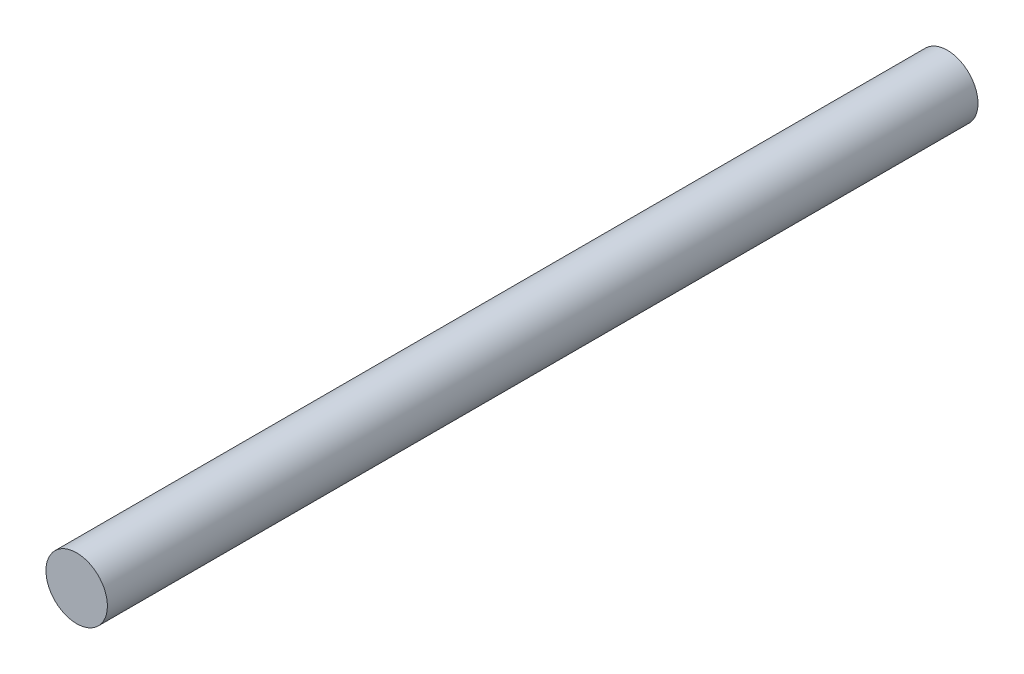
ISO-10303-21;
HEADER;
FILE_DESCRIPTION(('STEP AP214'),'2;1');
FILE_NAME('part.step','',(''),(''),'','','');
FILE_SCHEMA(('AUTOMOTIVE_DESIGN { 1 0 10303 214 1 1 1 1 }'));
ENDSEC;
DATA;
#1=APPLICATION_CONTEXT('core data for automotive mechanical design processes');
#2=APPLICATION_PROTOCOL_DEFINITION('international standard','automotive_design',2000,#1);
#3=PRODUCT_CONTEXT('',#1,'mechanical');
#4=PRODUCT('Part','Part','',(#3));
#5=PRODUCT_RELATED_PRODUCT_CATEGORY('part','',(#4));
#6=PRODUCT_DEFINITION_FORMATION('','',#4);
#7=PRODUCT_DEFINITION_CONTEXT('part definition',#1,'design');
#8=PRODUCT_DEFINITION('design','',#6,#7);
#9=PRODUCT_DEFINITION_SHAPE('','',#8);
#10=(LENGTH_UNIT() NAMED_UNIT(*) SI_UNIT(.MILLI.,.METRE.));
#11=(NAMED_UNIT(*) PLANE_ANGLE_UNIT() SI_UNIT($,.RADIAN.));
#12=(NAMED_UNIT(*) SI_UNIT($,.STERADIAN.) SOLID_ANGLE_UNIT());
#13=UNCERTAINTY_MEASURE_WITH_UNIT(LENGTH_MEASURE(1.E-05),#10,'distance_accuracy_value','');
#14=(GEOMETRIC_REPRESENTATION_CONTEXT(3) GLOBAL_UNCERTAINTY_ASSIGNED_CONTEXT((#13)) GLOBAL_UNIT_ASSIGNED_CONTEXT((#10,
#11,#12)) REPRESENTATION_CONTEXT('',''));
#15=CARTESIAN_POINT('',(0.,0.,0.));
#16=DIRECTION('',(0.,0.,1.));
#17=DIRECTION('',(1.,0.,0.));
#18=AXIS2_PLACEMENT_3D('',#15,#16,#17);
#19=CARTESIAN_POINT('',(0.,0.,-850.));
#20=DIRECTION('',(0.,0.,1.));
#21=DIRECTION('',(1.,0.,0.));
#22=AXIS2_PLACEMENT_3D('',#19,#20,#21);
#23=CYLINDRICAL_SURFACE('',#22,30.);
#24=CARTESIAN_POINT('',(0.,0.,-850.));
#25=DIRECTION('',(0.,0.,1.));
#26=DIRECTION('',(1.,0.,0.));
#27=AXIS2_PLACEMENT_3D('',#24,#25,#26);
#28=CIRCLE('',#27,30.);
#29=CARTESIAN_POINT('',(30.,0.,-850.));
#30=VERTEX_POINT('',#29);
#31=EDGE_CURVE('E10',#30,#30,#28,.T.);
#32=ORIENTED_EDGE('',*,*,#31,.T.);
#33=EDGE_LOOP('',(#32));
#34=FACE_BOUND('',#33,.T.);
#35=CARTESIAN_POINT('',(0.,0.,0.));
#36=DIRECTION('',(0.,0.,1.));
#37=DIRECTION('',(1.,0.,0.));
#38=AXIS2_PLACEMENT_3D('',#35,#36,#37);
#39=CIRCLE('',#38,30.);
#40=CARTESIAN_POINT('',(30.,0.,0.));
#41=VERTEX_POINT('',#40);
#42=EDGE_CURVE('E40',#41,#41,#39,.T.);
#43=ORIENTED_EDGE('',*,*,#42,.F.);
#44=EDGE_LOOP('',(#43));
#45=FACE_BOUND('',#44,.T.);
#46=ADVANCED_FACE('F37',(#34,#45),#23,.T.);
#47=CARTESIAN_POINT('',(0.,0.,-850.));
#48=DIRECTION('',(0.,0.,1.));
#49=DIRECTION('',(1.,0.,0.));
#50=AXIS2_PLACEMENT_3D('',#47,#48,#49);
#51=PLANE('',#50);
#52=ORIENTED_EDGE('',*,*,#31,.F.);
#53=EDGE_LOOP('',(#52));
#54=FACE_BOUND('',#53,.T.);
#55=ADVANCED_FACE('F54',(#54),#51,.F.);
#56=CARTESIAN_POINT('',(0.,0.,0.));
#57=DIRECTION('',(0.,0.,1.));
#58=DIRECTION('',(1.,0.,0.));
#59=AXIS2_PLACEMENT_3D('',#56,#57,#58);
#60=PLANE('',#59);
#61=ORIENTED_EDGE('',*,*,#42,.T.);
#62=EDGE_LOOP('',(#61));
#63=FACE_BOUND('',#62,.T.);
#64=ADVANCED_FACE('F51',(#63),#60,.T.);
#65=CLOSED_SHELL('',(#46,#55,#64));
#66=MANIFOLD_SOLID_BREP('B2',#65);
#67=ADVANCED_BREP_SHAPE_REPRESENTATION('',(#18,#66),#14);
#68=SHAPE_DEFINITION_REPRESENTATION(#9,#67);
ENDSEC;
END-ISO-10303-21;
